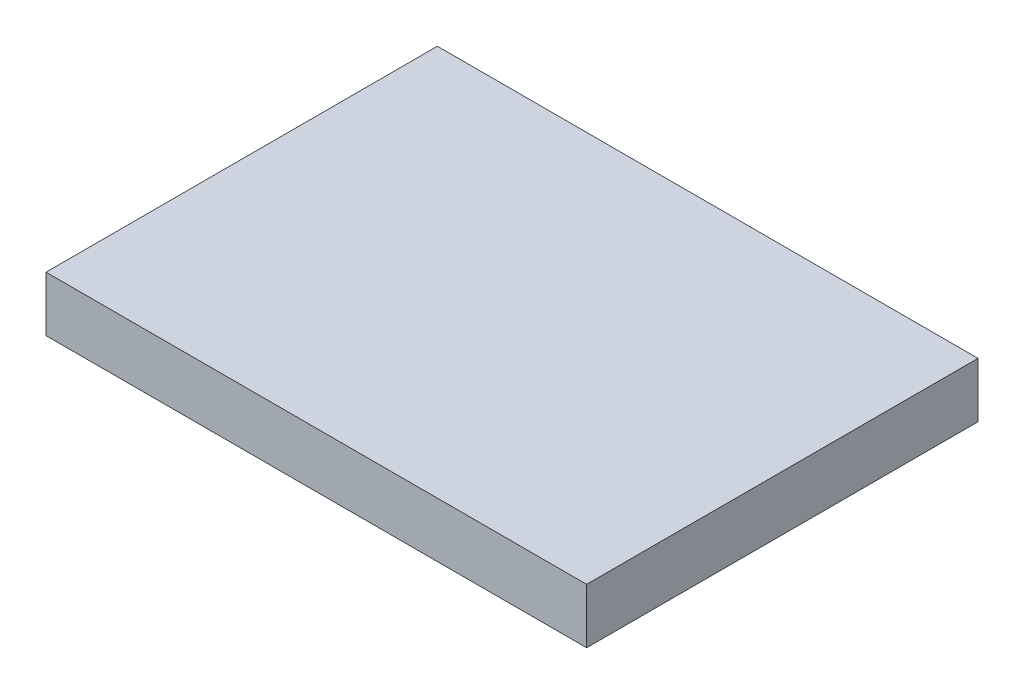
from build123d import *

# Parameters (mm, degrees)
SKETCH1_W           = 199.914488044
SKETCH1_H           = 144.722818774
BOSS_EXTRUDE1_DEPTH = 20.32


with BuildPart() as part:
    # Sketch1 → Boss-Extrude1 (new body)
    with BuildSketch(Plane(origin=(0, 0, 0), x_dir=(1, 0, 0), z_dir=(0, 1, 0))):
        Rectangle(SKETCH1_W, SKETCH1_H)
    extrude(amount=BOSS_EXTRUDE1_DEPTH)


solid = part.part
